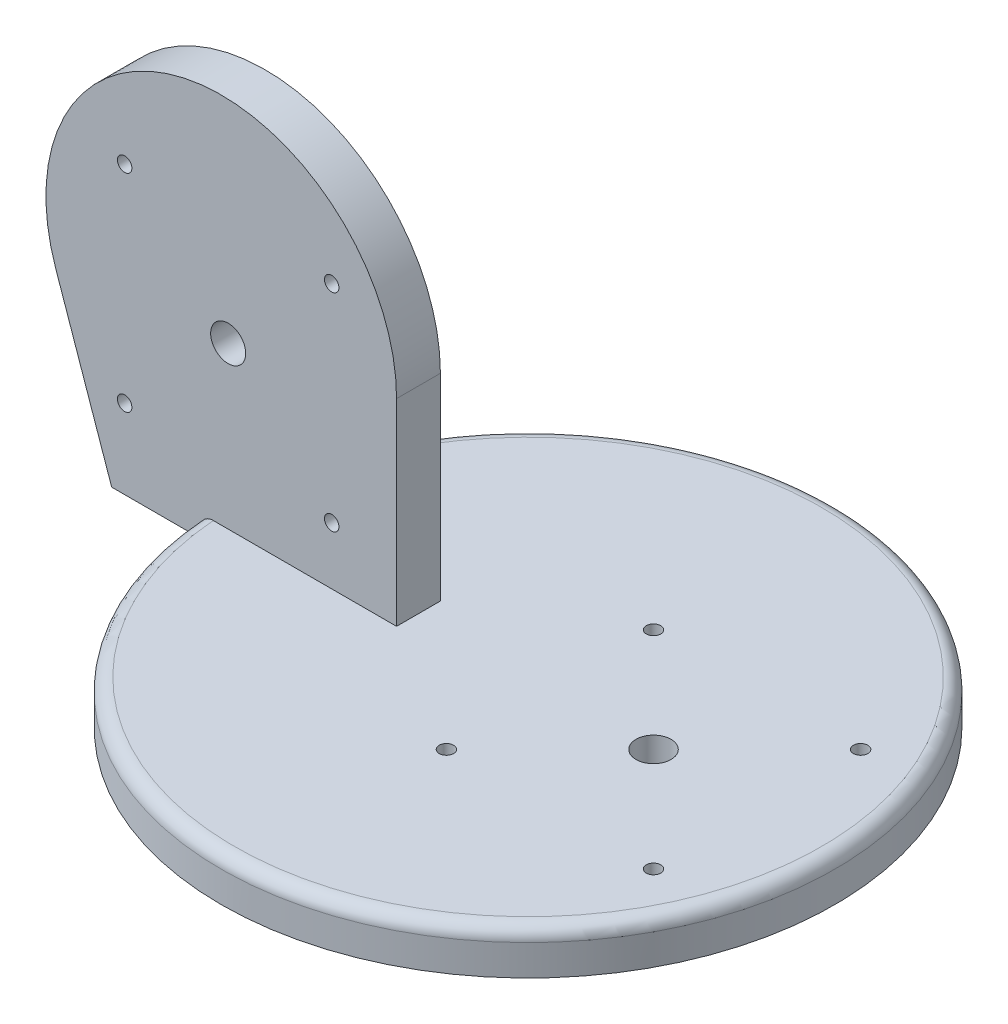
from build123d import *

# Parameters (mm, degrees)
SKETCH1_R                 = 70
BOSS_EXTRUDE1_DEPTH       = 10
SKETCH2_R                 = 65
BOSS_EXTRUDE4_DEPTH       = 3
BOSS_EXTRUDE5_DEPTH       = 5
M4X0_7_TAPPED_HOLE1_D     = 3.3
M4X0_7_TAPPED_HOLE1_DEPTH = 6
M4X0_7_TAPPED_HOLE1_TIP   = 0.991420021
F_8_0MM_DOWEL_HOLE2_D     = 8
M4X0_7_TAPPED_HOLE3_D     = 3.3
M4X0_7_TAPPED_HOLE3_DEPTH = 6
M4X0_7_TAPPED_HOLE3_TIP   = 0.991420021
F_8_0MM_DOWEL_HOLE3_D     = 8
FILLET1_R                 = 3


with BuildPart() as part:
    # Sketch1 → Boss-Extrude1 (new body)
    with BuildSketch(Plane(origin=(0, 0, 0), x_dir=(1, 0, 0), z_dir=(0, 1, 0))):
        with Locations(Location((0, 0, 0), (0, 0, 270))):
            Circle(SKETCH1_R)
    extrude(amount=BOSS_EXTRUDE1_DEPTH)

    # Sketch2 → Boss-Extrude4 (add)
    with BuildSketch(Plane.XZ):
        with Locations(Location((0, 0, 0), (0, 0, 270))):
            Circle(SKETCH2_R)
    extrude(amount=BOSS_EXTRUDE4_DEPTH)

    # Sketch3 → Boss-Extrude5 (add, symmetric)
    with BuildSketch(Plane.XY):
        with BuildLine():
            Line((-25, 55), (-25, 5))
            Line((-25, 5), (-90, 5))
            Line((-90, 5), (-102.792798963, 41.896399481))
            ThreePointArc((-102.792798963, 41.896399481), (-71.644096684, 94.444340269), (-25, 55))
        make_face()
    extrude(amount=BOSS_EXTRUDE5_DEPTH, both=True)

    # M4x0.7 Tapped Hole1
    with Locations(Plane(origin=(0, 10, 0), x_dir=(1, 0, 0), z_dir=(0, 1, 0))):
        with Locations((5, 23.622), (52.244, 23.622), (52.244, -23.622), (5, -23.622)):
            Hole(M4X0_7_TAPPED_HOLE1_D / 2, depth=M4X0_7_TAPPED_HOLE1_DEPTH)
            with Locations((0, 0, -(M4X0_7_TAPPED_HOLE1_DEPTH + M4X0_7_TAPPED_HOLE1_TIP / 2))):  # 118° drill point
                Cone(0, M4X0_7_TAPPED_HOLE1_D / 2, M4X0_7_TAPPED_HOLE1_TIP, mode=Mode.SUBTRACT)

    # 8.0mm Dowel Hole2 (through all)
    with Locations(Plane(origin=(0, 0, -5), x_dir=(1, 0, 0), z_dir=(0, 0, -1))):
        with Locations((-63.420285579, -46.697024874)):
            Hole(F_8_0MM_DOWEL_HOLE2_D / 2)

    # M4x0.7 Tapped Hole3
    with Locations(Plane.XY.offset(5)):
        with Locations((-87.040285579, 70.317024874), (-39.800285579, 70.317024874), (-39.800285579, 23.077024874), (-87.040285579, 23.077024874)):
            Hole(M4X0_7_TAPPED_HOLE3_D / 2, depth=M4X0_7_TAPPED_HOLE3_DEPTH)
            with Locations((0, 0, -(M4X0_7_TAPPED_HOLE3_DEPTH + M4X0_7_TAPPED_HOLE3_TIP / 2))):  # 118° drill point
                Cone(0, M4X0_7_TAPPED_HOLE3_D / 2, M4X0_7_TAPPED_HOLE3_TIP, mode=Mode.SUBTRACT)

    # 8.0mm Dowel Hole3 (through all)
    with Locations(Plane(origin=(0, 10, 0), x_dir=(1, 0, 0), z_dir=(0, 1, 0))):
        with Locations((28.624, -0.002)):
            Hole(F_8_0MM_DOWEL_HOLE3_D / 2)

    # Fillet1
    fillet1_edges = [part.edges().sort_by_distance(p)[0] for p in [
        (51.23475383, 10, -47.696960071),
    ]]
    fillet(fillet1_edges, radius=FILLET1_R)


solid = part.part
